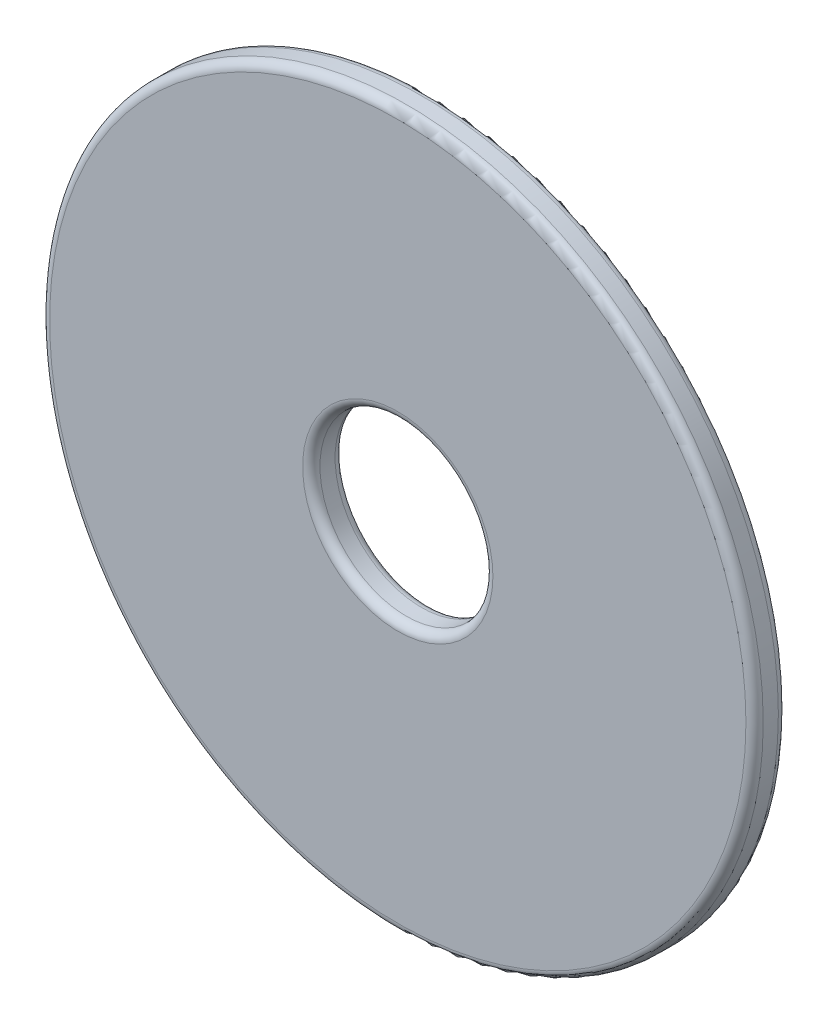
from build123d import *

# Parameters (mm, degrees)
ESQUISSE1_R      = 8.25
ESQUISSE1_R_2    = 2
EXTRUSION1_DEPTH = 0.75
CONG_1_R         = 0.2


with BuildPart() as part:
    # Esquisse1 → Extrusion1 (new body)
    with BuildSketch(Plane.XY):
        Circle(ESQUISSE1_R)
        Circle(ESQUISSE1_R_2, mode=Mode.SUBTRACT)
    extrude(amount=EXTRUSION1_DEPTH)

    # Cong_1
    cong_1_edges = [part.edges().sort_by_distance(p)[0] for p in [
        (-8.25, 0, 0),
        (-8.25, 0, 0.75),
        (-2, 0, 0),
        (-2, 0, 0.75),
    ]]
    fillet(cong_1_edges, radius=CONG_1_R)


solid = part.part
